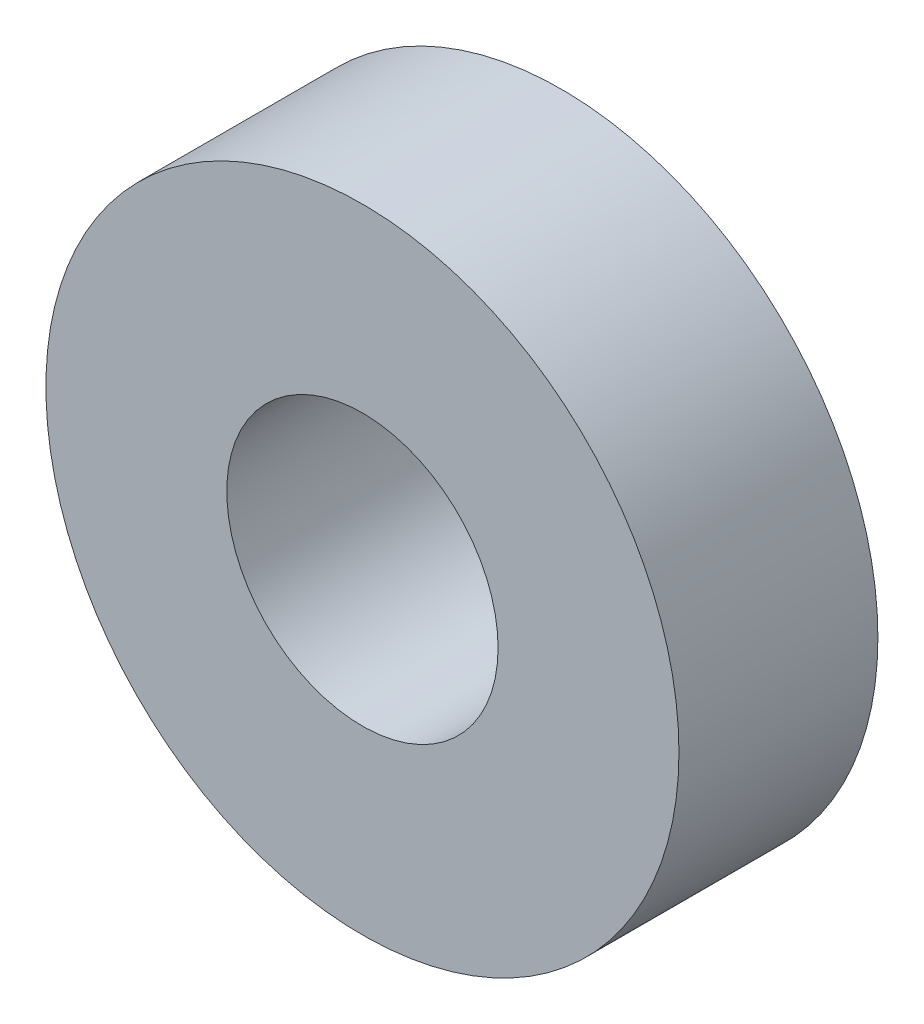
ISO-10303-21;
HEADER;
FILE_DESCRIPTION(('STEP AP214'),'2;1');
FILE_NAME('part.step','',(''),(''),'','','');
FILE_SCHEMA(('AUTOMOTIVE_DESIGN { 1 0 10303 214 1 1 1 1 }'));
ENDSEC;
DATA;
#1=APPLICATION_CONTEXT('core data for automotive mechanical design processes');
#2=APPLICATION_PROTOCOL_DEFINITION('international standard','automotive_design',2000,#1);
#3=PRODUCT_CONTEXT('',#1,'mechanical');
#4=PRODUCT('Part','Part','',(#3));
#5=PRODUCT_RELATED_PRODUCT_CATEGORY('part','',(#4));
#6=PRODUCT_DEFINITION_FORMATION('','',#4);
#7=PRODUCT_DEFINITION_CONTEXT('part definition',#1,'design');
#8=PRODUCT_DEFINITION('design','',#6,#7);
#9=PRODUCT_DEFINITION_SHAPE('','',#8);
#10=(LENGTH_UNIT() NAMED_UNIT(*) SI_UNIT(.MILLI.,.METRE.));
#11=(NAMED_UNIT(*) PLANE_ANGLE_UNIT() SI_UNIT($,.RADIAN.));
#12=(NAMED_UNIT(*) SI_UNIT($,.STERADIAN.) SOLID_ANGLE_UNIT());
#13=UNCERTAINTY_MEASURE_WITH_UNIT(LENGTH_MEASURE(1.E-05),#10,'distance_accuracy_value','');
#14=(GEOMETRIC_REPRESENTATION_CONTEXT(3) GLOBAL_UNCERTAINTY_ASSIGNED_CONTEXT((#13)) GLOBAL_UNIT_ASSIGNED_CONTEXT((#10,
#11,#12)) REPRESENTATION_CONTEXT('',''));
#15=CARTESIAN_POINT('',(0.,0.,0.));
#16=DIRECTION('',(0.,0.,1.));
#17=DIRECTION('',(1.,0.,0.));
#18=AXIS2_PLACEMENT_3D('',#15,#16,#17);
#19=CARTESIAN_POINT('',(0.,0.,11.));
#20=DIRECTION('',(0.,0.,-1.));
#21=DIRECTION('',(-1.,0.,0.));
#22=AXIS2_PLACEMENT_3D('',#19,#20,#21);
#23=CYLINDRICAL_SURFACE('',#22,17.5);
#24=CARTESIAN_POINT('',(0.,0.,11.));
#25=DIRECTION('',(0.,0.,1.));
#26=DIRECTION('',(1.,0.,0.));
#27=AXIS2_PLACEMENT_3D('',#24,#25,#26);
#28=CIRCLE('',#27,17.5);
#29=CARTESIAN_POINT('',(17.5,0.,11.));
#30=VERTEX_POINT('',#29);
#31=EDGE_CURVE('E10',#30,#30,#28,.T.);
#32=ORIENTED_EDGE('',*,*,#31,.F.);
#33=EDGE_LOOP('',(#32));
#34=FACE_BOUND('',#33,.T.);
#35=CARTESIAN_POINT('',(0.,0.,0.));
#36=DIRECTION('',(0.,0.,1.));
#37=DIRECTION('',(1.,0.,0.));
#38=AXIS2_PLACEMENT_3D('',#35,#36,#37);
#39=CIRCLE('',#38,17.5);
#40=CARTESIAN_POINT('',(17.5,0.,0.));
#41=VERTEX_POINT('',#40);
#42=EDGE_CURVE('E44',#41,#41,#39,.T.);
#43=ORIENTED_EDGE('',*,*,#42,.T.);
#44=EDGE_LOOP('',(#43));
#45=FACE_BOUND('',#44,.T.);
#46=ADVANCED_FACE('F41',(#34,#45),#23,.T.);
#47=CARTESIAN_POINT('',(0.,0.,11.));
#48=DIRECTION('',(0.,0.,1.));
#49=DIRECTION('',(1.,0.,0.));
#50=AXIS2_PLACEMENT_3D('',#47,#48,#49);
#51=PLANE('',#50);
#52=CARTESIAN_POINT('',(0.,0.,11.));
#53=DIRECTION('',(0.,0.,1.));
#54=DIRECTION('',(1.,0.,0.));
#55=AXIS2_PLACEMENT_3D('',#52,#53,#54);
#56=CIRCLE('',#55,7.5);
#57=CARTESIAN_POINT('',(7.5,0.,11.));
#58=VERTEX_POINT('',#57);
#59=EDGE_CURVE('E55',#58,#58,#56,.T.);
#60=ORIENTED_EDGE('',*,*,#59,.F.);
#61=EDGE_LOOP('',(#60));
#62=FACE_BOUND('',#61,.T.);
#63=ORIENTED_EDGE('',*,*,#31,.T.);
#64=EDGE_LOOP('',(#63));
#65=FACE_BOUND('',#64,.T.);
#66=ADVANCED_FACE('F72',(#62,#65),#51,.T.);
#67=CARTESIAN_POINT('',(0.,0.,0.));
#68=DIRECTION('',(0.,0.,1.));
#69=DIRECTION('',(1.,0.,0.));
#70=AXIS2_PLACEMENT_3D('',#67,#68,#69);
#71=PLANE('',#70);
#72=CARTESIAN_POINT('',(0.,0.,0.));
#73=DIRECTION('',(0.,0.,1.));
#74=DIRECTION('',(1.,0.,0.));
#75=AXIS2_PLACEMENT_3D('',#72,#73,#74);
#76=CIRCLE('',#75,7.5);
#77=CARTESIAN_POINT('',(7.5,0.,0.));
#78=VERTEX_POINT('',#77);
#79=EDGE_CURVE('E53',#78,#78,#76,.T.);
#80=ORIENTED_EDGE('',*,*,#79,.T.);
#81=EDGE_LOOP('',(#80));
#82=FACE_BOUND('',#81,.T.);
#83=ORIENTED_EDGE('',*,*,#42,.F.);
#84=EDGE_LOOP('',(#83));
#85=FACE_BOUND('',#84,.T.);
#86=ADVANCED_FACE('F63',(#82,#85),#71,.F.);
#87=CARTESIAN_POINT('',(0.,0.,0.));
#88=DIRECTION('',(0.,0.,1.));
#89=DIRECTION('',(1.,0.,0.));
#90=AXIS2_PLACEMENT_3D('',#87,#88,#89);
#91=CYLINDRICAL_SURFACE('',#90,7.5);
#92=ORIENTED_EDGE('',*,*,#79,.F.);
#93=EDGE_LOOP('',(#92));
#94=FACE_BOUND('',#93,.T.);
#95=ORIENTED_EDGE('',*,*,#59,.T.);
#96=EDGE_LOOP('',(#95));
#97=FACE_BOUND('',#96,.T.);
#98=ADVANCED_FACE('F66',(#94,#97),#91,.F.);
#99=CLOSED_SHELL('',(#46,#66,#86,#98));
#100=MANIFOLD_SOLID_BREP('B2',#99);
#101=ADVANCED_BREP_SHAPE_REPRESENTATION('',(#18,#100),#14);
#102=SHAPE_DEFINITION_REPRESENTATION(#9,#101);
ENDSEC;
END-ISO-10303-21;
